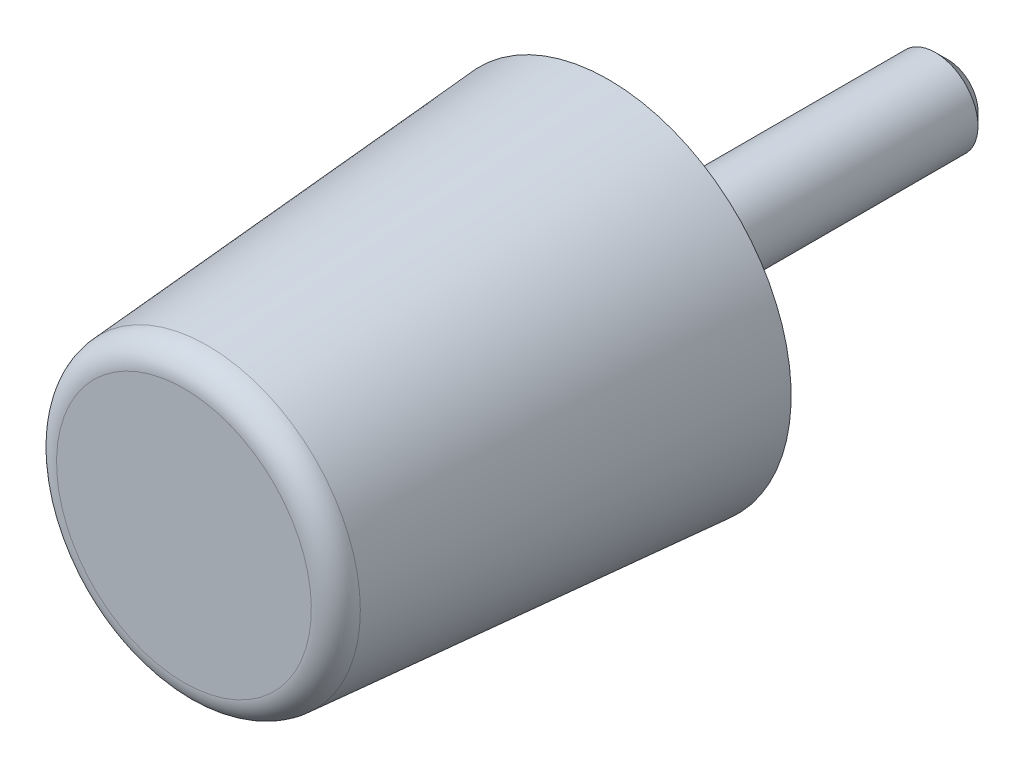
ISO-10303-21;
HEADER;
FILE_DESCRIPTION(('STEP AP214'),'2;1');
FILE_NAME('part.step','',(''),(''),'','','');
FILE_SCHEMA(('AUTOMOTIVE_DESIGN { 1 0 10303 214 1 1 1 1 }'));
ENDSEC;
DATA;
#1=APPLICATION_CONTEXT('core data for automotive mechanical design processes');
#2=APPLICATION_PROTOCOL_DEFINITION('international standard','automotive_design',2000,#1);
#3=PRODUCT_CONTEXT('',#1,'mechanical');
#4=PRODUCT('Part','Part','',(#3));
#5=PRODUCT_RELATED_PRODUCT_CATEGORY('part','',(#4));
#6=PRODUCT_DEFINITION_FORMATION('','',#4);
#7=PRODUCT_DEFINITION_CONTEXT('part definition',#1,'design');
#8=PRODUCT_DEFINITION('design','',#6,#7);
#9=PRODUCT_DEFINITION_SHAPE('','',#8);
#10=(LENGTH_UNIT() NAMED_UNIT(*) SI_UNIT(.MILLI.,.METRE.));
#11=(NAMED_UNIT(*) PLANE_ANGLE_UNIT() SI_UNIT($,.RADIAN.));
#12=(NAMED_UNIT(*) SI_UNIT($,.STERADIAN.) SOLID_ANGLE_UNIT());
#13=UNCERTAINTY_MEASURE_WITH_UNIT(LENGTH_MEASURE(1.E-05),#10,'distance_accuracy_value','');
#14=(GEOMETRIC_REPRESENTATION_CONTEXT(3) GLOBAL_UNCERTAINTY_ASSIGNED_CONTEXT((#13)) GLOBAL_UNIT_ASSIGNED_CONTEXT((#10,
#11,#12)) REPRESENTATION_CONTEXT('',''));
#15=CARTESIAN_POINT('',(0.,0.,0.));
#16=DIRECTION('',(0.,0.,1.));
#17=DIRECTION('',(1.,0.,0.));
#18=AXIS2_PLACEMENT_3D('',#15,#16,#17);
#19=CARTESIAN_POINT('',(0.,0.,50.));
#20=DIRECTION('',(0.,0.,1.));
#21=DIRECTION('',(0.,-1.,0.));
#22=AXIS2_PLACEMENT_3D('',#19,#20,#21);
#23=CYLINDRICAL_SURFACE('',#22,19.35);
#24=CARTESIAN_POINT('',(0.,0.,0.));
#25=DIRECTION('',(0.,0.,1.));
#26=DIRECTION('',(0.,-1.,0.));
#27=AXIS2_PLACEMENT_3D('',#24,#25,#26);
#28=CIRCLE('',#27,19.35);
#29=CARTESIAN_POINT('',(0.,-19.35,0.));
#30=VERTEX_POINT('',#29);
#31=EDGE_CURVE('E27',#30,#30,#28,.T.);
#32=ORIENTED_EDGE('',*,*,#31,.F.);
#33=EDGE_LOOP('',(#32));
#34=FACE_BOUND('',#33,.T.);
#35=CARTESIAN_POINT('',(0.,0.,0.0500000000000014));
#36=DIRECTION('',(0.,0.,1.));
#37=DIRECTION('',(0.,-1.,0.));
#38=AXIS2_PLACEMENT_3D('',#35,#36,#37);
#39=CIRCLE('',#38,19.35);
#40=CARTESIAN_POINT('',(0.,-19.35,0.0500000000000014));
#41=VERTEX_POINT('',#40);
#42=EDGE_CURVE('E44',#41,#41,#39,.T.);
#43=ORIENTED_EDGE('',*,*,#42,.T.);
#44=EDGE_LOOP('',(#43));
#45=FACE_BOUND('',#44,.T.);
#46=ADVANCED_FACE('F12',(#34,#45),#23,.F.);
#47=CARTESIAN_POINT('',(19.35,0.,0.));
#48=DIRECTION('',(0.,0.,1.));
#49=DIRECTION('',(0.,-1.,0.));
#50=AXIS2_PLACEMENT_3D('',#47,#48,#49);
#51=PLANE('',#50);
#52=CARTESIAN_POINT('',(0.,0.,0.));
#53=DIRECTION('',(0.,0.,1.));
#54=DIRECTION('',(0.,-1.,0.));
#55=AXIS2_PLACEMENT_3D('',#52,#53,#54);
#56=CIRCLE('',#55,21.5);
#57=CARTESIAN_POINT('',(0.,-21.5,0.));
#58=VERTEX_POINT('',#57);
#59=EDGE_CURVE('E32',#58,#58,#56,.T.);
#60=ORIENTED_EDGE('',*,*,#59,.F.);
#61=EDGE_LOOP('',(#60));
#62=FACE_BOUND('',#61,.T.);
#63=ORIENTED_EDGE('',*,*,#31,.T.);
#64=EDGE_LOOP('',(#63));
#65=FACE_BOUND('',#64,.T.);
#66=ADVANCED_FACE('F72',(#62,#65),#51,.F.);
#67=CARTESIAN_POINT('',(0.,0.,0.));
#68=DIRECTION('',(0.,0.,-1.));
#69=DIRECTION('',(0.,1.,0.));
#70=AXIS2_PLACEMENT_3D('',#67,#68,#69);
#71=CONICAL_SURFACE('',#70,21.5,0.0741559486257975);
#72=CARTESIAN_POINT('',(0.,0.,47.2222640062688));
#73=DIRECTION('',(0.,0.,1.));
#74=DIRECTION('',(0.,-1.,0.));
#75=AXIS2_PLACEMENT_3D('',#72,#73,#74);
#76=CIRCLE('',#75,17.9917551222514);
#77=CARTESIAN_POINT('',(0.,-17.9917551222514,47.2222640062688));
#78=VERTEX_POINT('',#77);
#79=EDGE_CURVE('E35',#78,#78,#76,.T.);
#80=ORIENTED_EDGE('',*,*,#79,.F.);
#81=EDGE_LOOP('',(#80));
#82=FACE_BOUND('',#81,.T.);
#83=ORIENTED_EDGE('',*,*,#59,.T.);
#84=EDGE_LOOP('',(#83));
#85=FACE_BOUND('',#84,.T.);
#86=ADVANCED_FACE('F77',(#82,#85),#71,.T.);
#87=CARTESIAN_POINT('',(0.,0.,47.));
#88=DIRECTION('',(0.,0.,1.));
#89=DIRECTION('',(0.,-1.,0.));
#90=AXIS2_PLACEMENT_3D('',#87,#88,#89);
#91=TOROIDAL_SURFACE('',#90,15.,3.);
#92=ORIENTED_EDGE('',*,*,#79,.T.);
#93=EDGE_LOOP('',(#92));
#94=FACE_BOUND('',#93,.T.);
#95=CARTESIAN_POINT('',(0.,0.,50.));
#96=DIRECTION('',(0.,0.,1.));
#97=DIRECTION('',(0.,-1.,0.));
#98=AXIS2_PLACEMENT_3D('',#95,#96,#97);
#99=CIRCLE('',#98,15.);
#100=CARTESIAN_POINT('',(0.,-15.,50.));
#101=VERTEX_POINT('',#100);
#102=EDGE_CURVE('E38',#101,#101,#99,.T.);
#103=ORIENTED_EDGE('',*,*,#102,.F.);
#104=EDGE_LOOP('',(#103));
#105=FACE_BOUND('',#104,.T.);
#106=ADVANCED_FACE('F84',(#94,#105),#91,.T.);
#107=CARTESIAN_POINT('',(15.,0.,50.));
#108=DIRECTION('',(0.,0.,-1.));
#109=DIRECTION('',(0.,1.,0.));
#110=AXIS2_PLACEMENT_3D('',#107,#108,#109);
#111=PLANE('',#110);
#112=ORIENTED_EDGE('',*,*,#102,.T.);
#113=EDGE_LOOP('',(#112));
#114=FACE_BOUND('',#113,.T.);
#115=ADVANCED_FACE('F59',(#114),#111,.F.);
#116=CARTESIAN_POINT('',(0.,0.,0.));
#117=DIRECTION('',(0.,0.,1.));
#118=DIRECTION('',(0.,-1.,0.));
#119=AXIS2_PLACEMENT_3D('',#116,#117,#118);
#120=PLANE('',#119);
#121=CARTESIAN_POINT('',(0.,0.,0.));
#122=DIRECTION('',(0.,0.,1.));
#123=DIRECTION('',(0.,-1.,0.));
#124=AXIS2_PLACEMENT_3D('',#121,#122,#123);
#125=CIRCLE('',#124,19.3);
#126=CARTESIAN_POINT('',(0.,-19.3,0.));
#127=VERTEX_POINT('',#126);
#128=EDGE_CURVE('E41',#127,#127,#125,.T.);
#129=ORIENTED_EDGE('',*,*,#128,.F.);
#130=EDGE_LOOP('',(#129));
#131=FACE_BOUND('',#130,.T.);
#132=CARTESIAN_POINT('',(0.,0.,0.));
#133=DIRECTION('',(0.,0.,1.));
#134=DIRECTION('',(0.,-1.,0.));
#135=AXIS2_PLACEMENT_3D('',#132,#133,#134);
#136=CIRCLE('',#135,5.);
#137=CARTESIAN_POINT('',(0.,-5.,0.));
#138=VERTEX_POINT('',#137);
#139=EDGE_CURVE('E23',#138,#138,#136,.T.);
#140=ORIENTED_EDGE('',*,*,#139,.T.);
#141=EDGE_LOOP('',(#140));
#142=FACE_BOUND('',#141,.T.);
#143=ADVANCED_FACE('F53',(#131,#142),#120,.F.);
#144=CARTESIAN_POINT('',(0.,0.,0.));
#145=DIRECTION('',(0.,0.,1.));
#146=DIRECTION('',(0.,-1.,0.));
#147=AXIS2_PLACEMENT_3D('',#144,#145,#146);
#148=CONICAL_SURFACE('',#147,19.3,0.785398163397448);
#149=ORIENTED_EDGE('',*,*,#42,.F.);
#150=EDGE_LOOP('',(#149));
#151=FACE_BOUND('',#150,.T.);
#152=ORIENTED_EDGE('',*,*,#128,.T.);
#153=EDGE_LOOP('',(#152));
#154=FACE_BOUND('',#153,.T.);
#155=ADVANCED_FACE('F49',(#151,#154),#148,.T.);
#156=CARTESIAN_POINT('',(0.,0.,50.));
#157=DIRECTION('',(0.,0.,1.));
#158=DIRECTION('',(0.,-1.,0.));
#159=AXIS2_PLACEMENT_3D('',#156,#157,#158);
#160=CYLINDRICAL_SURFACE('',#159,5.);
#161=CARTESIAN_POINT('',(0.,0.,-38.5));
#162=DIRECTION('',(0.,0.,-1.));
#163=DIRECTION('',(0.,1.,0.));
#164=AXIS2_PLACEMENT_3D('',#161,#162,#163);
#165=CIRCLE('',#164,5.);
#166=CARTESIAN_POINT('',(0.,5.,-38.5));
#167=VERTEX_POINT('',#166);
#168=EDGE_CURVE('E8',#167,#167,#165,.F.);
#169=ORIENTED_EDGE('',*,*,#168,.T.);
#170=EDGE_LOOP('',(#169));
#171=FACE_BOUND('',#170,.T.);
#172=ORIENTED_EDGE('',*,*,#139,.F.);
#173=EDGE_LOOP('',(#172));
#174=FACE_BOUND('',#173,.T.);
#175=ADVANCED_FACE('F52',(#171,#174),#160,.T.);
#176=CARTESIAN_POINT('',(0.,0.,-40.));
#177=DIRECTION('',(0.,0.,-1.));
#178=DIRECTION('',(0.,1.,0.));
#179=AXIS2_PLACEMENT_3D('',#176,#177,#178);
#180=PLANE('',#179);
#181=CARTESIAN_POINT('',(0.,0.,-40.));
#182=DIRECTION('',(0.,0.,-1.));
#183=DIRECTION('',(0.,1.,0.));
#184=AXIS2_PLACEMENT_3D('',#181,#182,#183);
#185=CIRCLE('',#184,3.5);
#186=CARTESIAN_POINT('',(0.,3.5,-40.));
#187=VERTEX_POINT('',#186);
#188=EDGE_CURVE('E19',#187,#187,#185,.T.);
#189=ORIENTED_EDGE('',*,*,#188,.T.);
#190=EDGE_LOOP('',(#189));
#191=FACE_BOUND('',#190,.T.);
#192=ADVANCED_FACE('F64',(#191),#180,.T.);
#193=CARTESIAN_POINT('',(0.,0.,-40.));
#194=DIRECTION('',(0.,0.,1.));
#195=DIRECTION('',(0.,-1.,0.));
#196=AXIS2_PLACEMENT_3D('',#193,#194,#195);
#197=CONICAL_SURFACE('',#196,3.5,0.785398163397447);
#198=ORIENTED_EDGE('',*,*,#168,.F.);
#199=EDGE_LOOP('',(#198));
#200=FACE_BOUND('',#199,.T.);
#201=ORIENTED_EDGE('',*,*,#188,.F.);
#202=EDGE_LOOP('',(#201));
#203=FACE_BOUND('',#202,.T.);
#204=ADVANCED_FACE('F14',(#200,#203),#197,.T.);
#205=CLOSED_SHELL('',(#46,#66,#86,#106,#115,#143,#155,#175,#192,#204));
#206=MANIFOLD_SOLID_BREP('B1',#205);
#207=ADVANCED_BREP_SHAPE_REPRESENTATION('',(#18,#206),#14);
#208=SHAPE_DEFINITION_REPRESENTATION(#9,#207);
ENDSEC;
END-ISO-10303-21;
